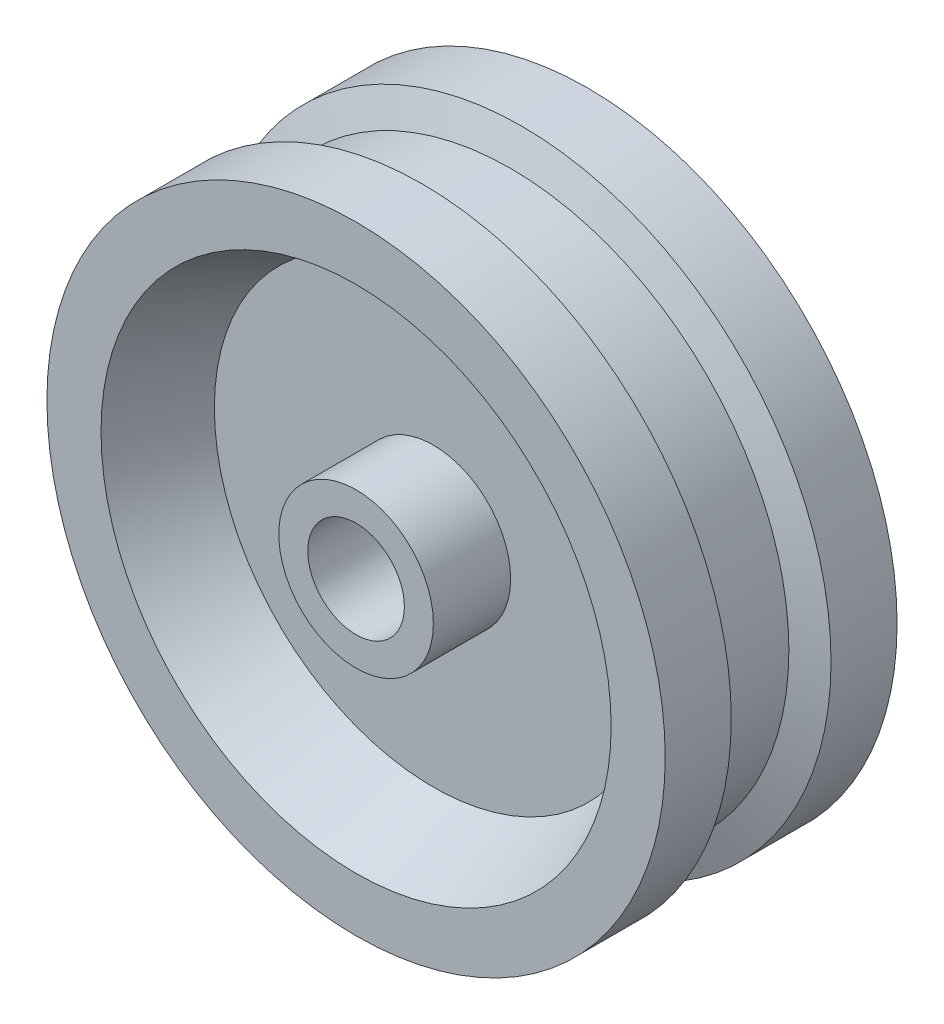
from build123d import *


with BuildPart() as part:
    # Sketch1 → Revolve1 (revolve)
    with BuildSketch(Plane(origin=(0, 0, 0), x_dir=(0, 0, -1), z_dir=(1, 0, 0)), mode=Mode.PRIVATE) as revolve1_sk:
        Polygon((-2.5, 5), (-2.5, 14.168461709), (-7.5, 16.5), (-7.5, 20), (-3.227940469, 20), (-2.5, 18), (2.5, 18), (3.227940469, 20), (7.5, 20), (7.5, 16.5), (2.5, 14.168461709), (2.5, 5), (7.5, 5), (7.5, 3.125), (-7.5, 3.125), (-7.5, 5), align=None)
    revolve(revolve1_sk.sketch.rotate(Axis((0, 0, 11.969820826), (0, 0, -1)), 90), axis=Axis((0, 0, 11.969820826), (0, 0, -1)))


solid = part.part
